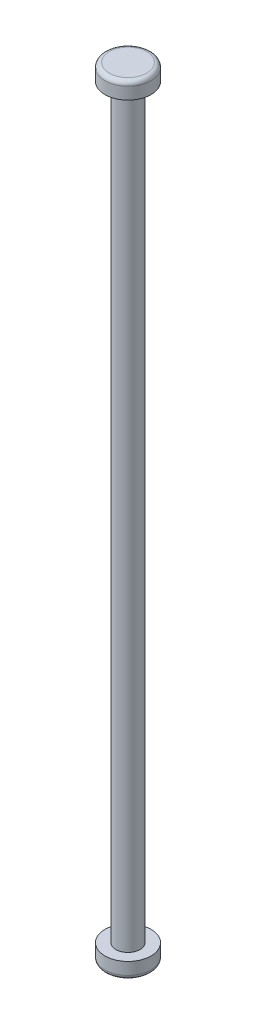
from build123d import *

# Parameters (mm, degrees)
SKETCH18_R          = 0.55
BOSS_EXTRUDE1_DEPTH = 17
SKETCH19_R          = 1.05
BOSS_EXTRUDE2_DEPTH = 0.75
FILLET2_R           = 0.2
FILLET3_R           = 0.2
SCALE1_SCALE        = 0.7


with BuildPart() as part:
    # Sketch18 → Boss-Extrude1 (new, symmetric)
    with BuildSketch(Plane(origin=(0, 0, 0), x_dir=(1, 0, 0), z_dir=(0, 1, 0))):
        with Locations(Location((0, 0, 0), (0, 0, 270))):
            Circle(SKETCH18_R)
    extrude(amount=BOSS_EXTRUDE1_DEPTH, both=True)

    # Sketch19 → Boss-Extrude2 (add)
    with BuildSketch(Plane(origin=(0, 17, 0), x_dir=(1, 0, 0), z_dir=(0, 1, 0))):
        with Locations(Location((0, 0, 0), (0, 0, 270))):
            Circle(SKETCH19_R)
    boss_extrude2 = extrude(amount=BOSS_EXTRUDE2_DEPTH)

    # Mirror1: Boss-Extrude2 across plane
    add(boss_extrude2.mirror(Plane.ZX))

    # Fillet2
    fillet2_edges = [part.edges().sort_by_distance(p)[0] for p in [
        (0, 17.75, -1.05),
    ]]
    fillet(fillet2_edges, radius=FILLET2_R)

    # Fillet3
    fillet3_edges = [part.edges().sort_by_distance(p)[0] for p in [
        (0, -17.75, -1.05),
    ]]
    fillet(fillet3_edges, radius=FILLET3_R)


with BuildPart() as part_1:
    # Scale1: scaled about (0, 0, 0)
    add(part.part.scale(SCALE1_SCALE))


solid = part_1.part
